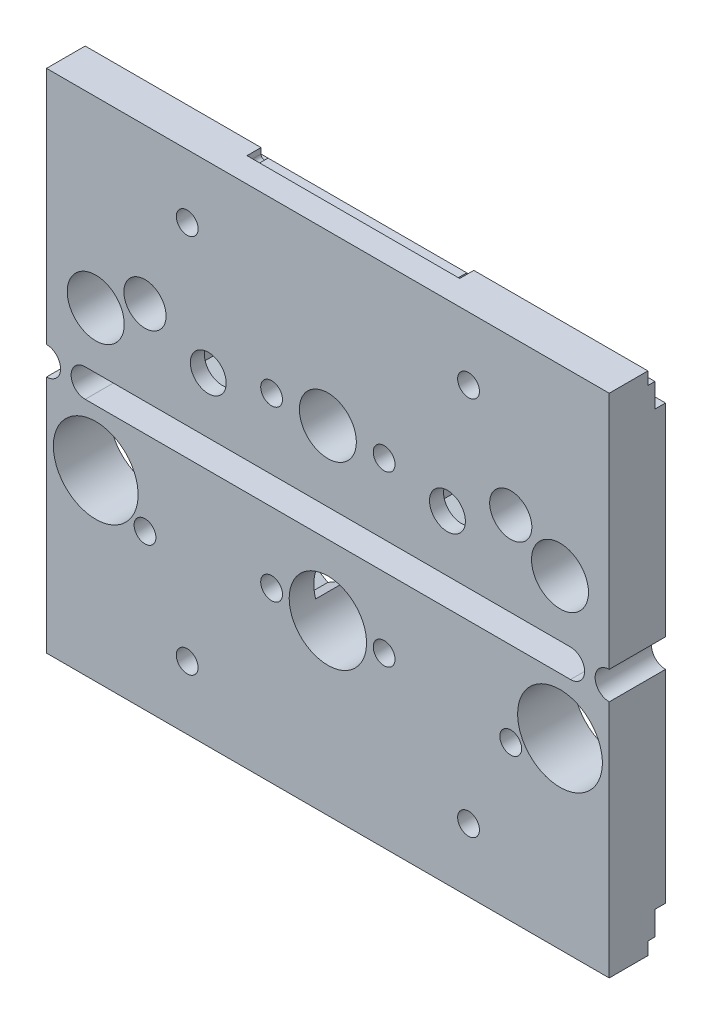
from build123d import *

# Parameters (mm, degrees)
SKETCH_2_W           = 80
SKETCH_2_H           = 34
SKETCH_2_R           = 4.05
EXTRUDE_1_DEPTH      = 8
SKETCH_3_R           = 2.55
CUT_EXTRUDE_1_DEPTH  = 88.292611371
CUT_EXTRUDE_2_DEPTH  = 88.292611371
SKETCH_5_R           = 1.55
CUT_EXTRUDE_3_DEPTH  = 88.292611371
CUT_EXTRUDE_5_DEPTH  = 4.5
SKETCH_25_R          = 1.55
CUT_EXTRUDE_13_DEPTH = 88.292611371
CUT_EXTRUDE_11_DEPTH = 2
EXTRUDE_2_DEPTH      = 8
SKETCH_26_R          = 6.025
CUT_EXTRUDE_14_DEPTH = 89.926936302
SKETCH_27_R          = 3
SKETCH_27_R_2        = 1.55
CUT_EXTRUDE_15_DEPTH = 89.926936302
CUT_EXTRUDE_16_DEPTH = 6
SKETCH_29_R          = 5.5
CUT_EXTRUDE_17_DEPTH = 89.926936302


with BuildPart() as part:
    # Sketch 2 → Extrude 1 (new body)
    with BuildSketch(Plane.XY):
        with Locations((40, 17)):
            Rectangle(SKETCH_2_W, SKETCH_2_H)
        with Locations((7, 8)):
            Circle(SKETCH_2_R, mode=Mode.SUBTRACT)
        with Locations((40, 10)):
            Circle(SKETCH_2_R, mode=Mode.SUBTRACT)
        with Locations((73, 8)):
            Circle(SKETCH_2_R, mode=Mode.SUBTRACT)
    extrude_1 = extrude(amount=EXTRUDE_1_DEPTH)

    # Sketch 3 → Cut-Extrude 1 (cut, through all)
    with BuildSketch(Plane.XY.offset(8)):
        with Locations((23, 8)):
            Circle(SKETCH_3_R)
        with Locations((57, 8)):
            Circle(SKETCH_3_R)
    extrude(amount=-CUT_EXTRUDE_1_DEPTH, mode=Mode.SUBTRACT)

    # Sketch 4 → Cut-Extrude 2 (cut, through all)
    with BuildSketch(Plane(origin=(80, 0, 0), x_dir=(0, 0, -1), z_dir=(1, 0, 0))):
        Polygon((-1.5, 32.2), (-2.5, 32.2), (-2.5, 34), (0, 34), (0, 28.8), (-1.5, 28.8), align=None)
    cut_extrude_2 = extrude(amount=-CUT_EXTRUDE_2_DEPTH, mode=Mode.SUBTRACT)

    # Sketch 5 → Cut-Extrude 3 (cut, through all)
    with BuildSketch(Plane.XY.offset(8)):
        with Locations((48, 10)):
            Circle(SKETCH_5_R)
        with Locations((32, 10)):
            Circle(SKETCH_5_R)
    cut_extrude_3 = extrude(amount=-CUT_EXTRUDE_3_DEPTH, mode=Mode.SUBTRACT)

    # Sketch 8 → Cut-Extrude 5 (cut)
    with BuildSketch(Plane(origin=(0, 0, 0), x_dir=(-1, 0, 0), z_dir=(0, 0, -1))):
        Polygon((-45.15, 8.354551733), (-45.15, 11.645448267), (-48, 13.290896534), (-50.85, 11.645448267), (-50.85, 8.354551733), (-48, 6.709103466), align=None)
        Polygon((-29.15, 8.354551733), (-29.15, 11.645448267), (-32, 13.290896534), (-34.85, 11.645448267), (-34.85, 8.354551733), (-32, 6.709103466), align=None)
    cut_extrude_5 = extrude(amount=-CUT_EXTRUDE_5_DEPTH, mode=Mode.SUBTRACT)

    # Sketch 25 → Cut-Extrude 13 (cut, through all)
    with BuildSketch(Plane(origin=(0, 0, 0), x_dir=(-1, 0, 0), z_dir=(0, 0, -1))):
        with Locations((-60, 25)):
            Circle(SKETCH_25_R)
        with Locations((-20, 25)):
            Circle(SKETCH_25_R)
    cut_extrude_13 = extrude(amount=-CUT_EXTRUDE_13_DEPTH, mode=Mode.SUBTRACT)

    # Sketch 19 → Cut-Extrude 11 (cut)
    with BuildSketch(Plane(origin=(0, 0, 2.5), x_dir=(-1, 0, 0), z_dir=(0, 0, -1))):
        with BuildLine():
            Line((-25, 34), (-55.247938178, 34))
            Line((-55.247938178, 34), (-55.247938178, 33.2))
            ThreePointArc((-55.247938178, 33.2), (-54.747938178, 32.7), (-54.247938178, 33.2))
            Line((-54.247938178, 33.2), (-26, 33.2))
            ThreePointArc((-26, 33.2), (-25.5, 32.7), (-25, 33.2))
            Line((-25, 33.2), (-25, 34))
        make_face()
    cut_extrude_11 = extrude(amount=-CUT_EXTRUDE_11_DEPTH, mode=Mode.SUBTRACT)

    # Sketch 22 → Extrude 2 (add)
    with BuildSketch(Plane.XY.offset(8)):
        with BuildLine():
            Line((0, -4), (5.5, -4))
            ThreePointArc((5.5, -4), (3.5, -2), (5.5, 0))
            Line((5.5, 0), (0, 0))
            ThreePointArc((0, 0), (2, -2), (0, -4))
        make_face()
        with BuildLine():
            Line((80, 0), (74.5, 0))
            ThreePointArc((74.5, 0), (76.5, -2), (74.5, -4))
            Line((74.5, -4), (80, -4))
            ThreePointArc((80, -4), (78, -2), (80, 0))
        make_face()
    extrude(amount=-EXTRUDE_2_DEPTH)

    # Mirror 2: Extrude 1, Cut-Extrude 2, Cut-Extrude 3, Cut-Extrude 5, Cut-Extrude 13, Cut-Extrude 11 across plane
    add(extrude_1.mirror(Plane(origin=(0, -2, 0), x_dir=(0, 0, 1), z_dir=(0, -1, 0))))
    add(cut_extrude_2.mirror(Plane(origin=(0, -2, 0), x_dir=(0, 0, 1), z_dir=(0, -1, 0))), mode=Mode.SUBTRACT)
    add(cut_extrude_3.mirror(Plane(origin=(0, -2, 0), x_dir=(0, 0, 1), z_dir=(0, -1, 0))), mode=Mode.SUBTRACT)
    add(cut_extrude_5.mirror(Plane(origin=(0, -2, 0), x_dir=(0, 0, 1), z_dir=(0, -1, 0))), mode=Mode.SUBTRACT)
    add(cut_extrude_13.mirror(Plane(origin=(0, -2, 0), x_dir=(0, 0, 1), z_dir=(0, -1, 0))), mode=Mode.SUBTRACT)
    add(cut_extrude_11.mirror(Plane(origin=(0, -2, 0), x_dir=(0, 0, 1), z_dir=(0, -1, 0))), mode=Mode.SUBTRACT)

    # Sketch 26 → Cut-Extrude 14 (cut, through all)
    with BuildSketch(Plane(origin=(0, 0, 0), x_dir=(-1, 0, 0), z_dir=(0, 0, -1))):
        with Locations((-73, -12)):
            Circle(SKETCH_26_R)
        with Locations((-7, -12)):
            Circle(SKETCH_26_R)
    extrude(amount=-CUT_EXTRUDE_14_DEPTH, mode=Mode.SUBTRACT)

    # Sketch 27 → Cut-Extrude 15 (cut, through all)
    with BuildSketch(Plane(origin=(0, 0, 0), x_dir=(-1, 0, 0), z_dir=(0, 0, -1))):
        with Locations((-66, 12)):
            Circle(SKETCH_27_R)
        with Locations((-66, -16)):
            Circle(SKETCH_27_R_2)
        with Locations(Location((-14, -16, 0), (0, 0, 180))):
            Circle(SKETCH_27_R_2)
        with Locations(Location((-14, 12, 0), (0, 0, 180))):
            Circle(SKETCH_27_R)
    extrude(amount=-CUT_EXTRUDE_15_DEPTH, mode=Mode.SUBTRACT)

    # Sketch 28 → Cut-Extrude 16 (cut)
    with BuildSketch(Plane(origin=(0, 0, 0), x_dir=(-1, 0, 0), z_dir=(0, 0, -1))):
        Polygon((-52.9, 5.632863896), (-52.9, 10.367136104), (-57, 12.734272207), (-61.1, 10.367136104), (-61.1, 5.632863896), (-57, 3.265727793), align=None)
        Polygon((-18.9, 5.632863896), (-18.9, 10.367136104), (-23, 12.734272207), (-27.1, 10.367136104), (-27.1, 5.632863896), (-23, 3.265727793), align=None)
    extrude(amount=-CUT_EXTRUDE_16_DEPTH, mode=Mode.SUBTRACT)

    # Sketch 29 → Cut-Extrude 17 (cut, through all)
    with BuildSketch(Plane(origin=(0, 0, 0), x_dir=(-1, 0, 0), z_dir=(0, 0, -1))):
        with Locations((-40, -14)):
            Circle(SKETCH_29_R)
    extrude(amount=-CUT_EXTRUDE_17_DEPTH, mode=Mode.SUBTRACT)


solid = part.part
